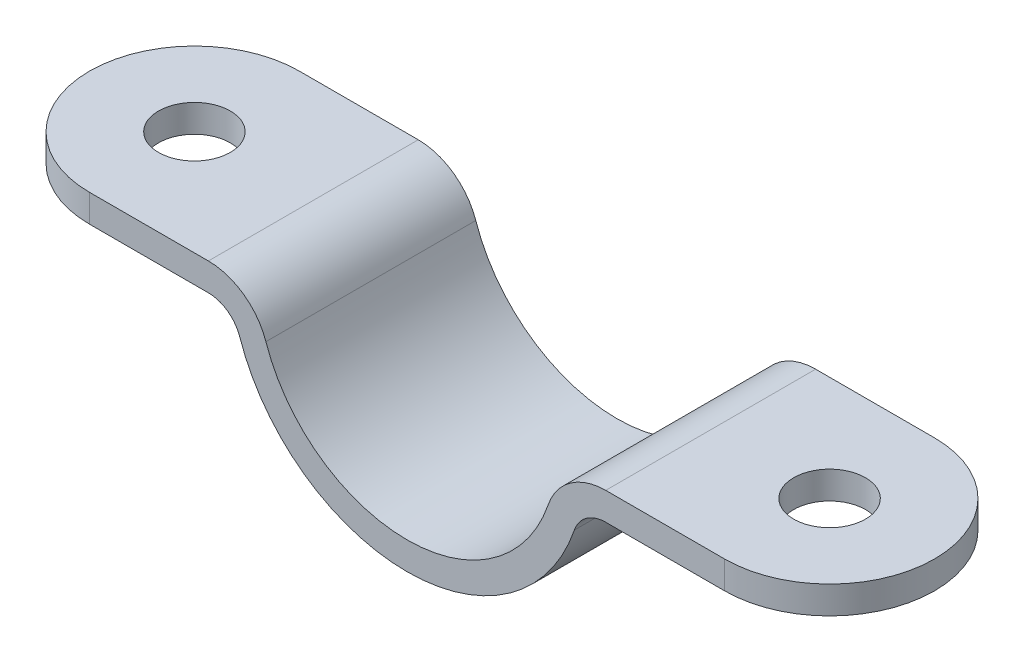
ISO-10303-21;
HEADER;
FILE_DESCRIPTION(('STEP AP214'),'2;1');
FILE_NAME('part.step','',(''),(''),'','','');
FILE_SCHEMA(('AUTOMOTIVE_DESIGN { 1 0 10303 214 1 1 1 1 }'));
ENDSEC;
DATA;
#1=APPLICATION_CONTEXT('core data for automotive mechanical design processes');
#2=APPLICATION_PROTOCOL_DEFINITION('international standard','automotive_design',2000,#1);
#3=PRODUCT_CONTEXT('',#1,'mechanical');
#4=PRODUCT('Part','Part','',(#3));
#5=PRODUCT_RELATED_PRODUCT_CATEGORY('part','',(#4));
#6=PRODUCT_DEFINITION_FORMATION('','',#4);
#7=PRODUCT_DEFINITION_CONTEXT('part definition',#1,'design');
#8=PRODUCT_DEFINITION('design','',#6,#7);
#9=PRODUCT_DEFINITION_SHAPE('','',#8);
#10=(LENGTH_UNIT() NAMED_UNIT(*) SI_UNIT(.MILLI.,.METRE.));
#11=(NAMED_UNIT(*) PLANE_ANGLE_UNIT() SI_UNIT($,.RADIAN.));
#12=(NAMED_UNIT(*) SI_UNIT($,.STERADIAN.) SOLID_ANGLE_UNIT());
#13=UNCERTAINTY_MEASURE_WITH_UNIT(LENGTH_MEASURE(1.E-05),#10,'distance_accuracy_value','');
#14=(GEOMETRIC_REPRESENTATION_CONTEXT(3) GLOBAL_UNCERTAINTY_ASSIGNED_CONTEXT((#13)) GLOBAL_UNIT_ASSIGNED_CONTEXT((#10,
#11,#12)) REPRESENTATION_CONTEXT('',''));
#15=CARTESIAN_POINT('',(0.,0.,0.));
#16=DIRECTION('',(0.,0.,1.));
#17=DIRECTION('',(1.,0.,0.));
#18=AXIS2_PLACEMENT_3D('',#15,#16,#17);
#19=CARTESIAN_POINT('',(31.3837139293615,-6.25,-38.));
#20=DIRECTION('',(0.,-1.,0.));
#21=DIRECTION('',(0.,0.,-1.));
#22=AXIS2_PLACEMENT_3D('',#19,#20,#21);
#23=PLANE('',#22);
#24=CARTESIAN_POINT('',(57.5,-6.25,-19.));
#25=DIRECTION('',(0.,-1.,0.));
#26=DIRECTION('',(0.,0.,-1.));
#27=AXIS2_PLACEMENT_3D('',#24,#25,#26);
#28=CIRCLE('',#27,6.5);
#29=CARTESIAN_POINT('',(57.5,-6.25,-25.5));
#30=VERTEX_POINT('',#29);
#31=EDGE_CURVE('E150',#30,#30,#28,.T.);
#32=ORIENTED_EDGE('',*,*,#31,.F.);
#33=EDGE_LOOP('',(#32));
#34=FACE_BOUND('',#33,.T.);
#35=DIRECTION('',(1.,0.,0.));
#36=VECTOR('',#35,1.);
#37=CARTESIAN_POINT('',(31.3837139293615,-6.25,0.));
#38=LINE('',#37,#36);
#39=CARTESIAN_POINT('',(35.9713427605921,-6.25,0.));
#40=VERTEX_POINT('',#39);
#41=CARTESIAN_POINT('',(57.5,-6.25,0.));
#42=VERTEX_POINT('',#41);
#43=EDGE_CURVE('E180',#40,#42,#38,.T.);
#44=ORIENTED_EDGE('',*,*,#43,.F.);
#45=DIRECTION('',(0.,0.,-1.));
#46=VECTOR('',#45,1.);
#47=CARTESIAN_POINT('',(35.9713427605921,-6.25,-38.));
#48=LINE('',#47,#46);
#49=CARTESIAN_POINT('',(35.9713427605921,-6.25,-38.));
#50=VERTEX_POINT('',#49);
#51=EDGE_CURVE('E212',#40,#50,#48,.T.);
#52=ORIENTED_EDGE('',*,*,#51,.T.);
#53=DIRECTION('',(1.,0.,0.));
#54=VECTOR('',#53,1.);
#55=CARTESIAN_POINT('',(31.3837139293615,-6.25,-38.));
#56=LINE('',#55,#54);
#57=CARTESIAN_POINT('',(57.5,-6.25,-38.));
#58=VERTEX_POINT('',#57);
#59=EDGE_CURVE('E183',#50,#58,#56,.T.);
#60=ORIENTED_EDGE('',*,*,#59,.T.);
#61=CARTESIAN_POINT('',(57.5,-6.25,-19.));
#62=DIRECTION('',(0.,-1.,0.));
#63=DIRECTION('',(0.,0.,-1.));
#64=AXIS2_PLACEMENT_3D('',#61,#62,#63);
#65=CIRCLE('',#64,19.);
#66=EDGE_CURVE('E196',#58,#42,#65,.T.);
#67=ORIENTED_EDGE('',*,*,#66,.T.);
#68=EDGE_LOOP('',(#44,#52,#60,#67));
#69=FACE_BOUND('',#68,.T.);
#70=ADVANCED_FACE('F34',(#34,#69),#23,.T.);
#71=CARTESIAN_POINT('',(35.9713427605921,-12.25,-38.));
#72=DIRECTION('',(0.,0.,1.));
#73=DIRECTION('',(1.,0.,0.));
#74=AXIS2_PLACEMENT_3D('',#71,#72,#73);
#75=CYLINDRICAL_SURFACE('',#74,6.);
#76=CARTESIAN_POINT('',(35.9713427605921,-12.25,-38.));
#77=DIRECTION('',(0.,0.,1.));
#78=DIRECTION('',(1.,0.,0.));
#79=AXIS2_PLACEMENT_3D('',#76,#77,#78);
#80=CIRCLE('',#79,6.);
#81=CARTESIAN_POINT('',(30.2916570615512,-10.3157894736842,-38.));
#82=VERTEX_POINT('',#81);
#83=EDGE_CURVE('E43',#50,#82,#80,.T.);
#84=ORIENTED_EDGE('',*,*,#83,.F.);
#85=ORIENTED_EDGE('',*,*,#51,.F.);
#86=CARTESIAN_POINT('',(35.9713427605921,-12.25,0.));
#87=DIRECTION('',(0.,0.,1.));
#88=DIRECTION('',(1.,0.,0.));
#89=AXIS2_PLACEMENT_3D('',#86,#87,#88);
#90=CIRCLE('',#89,6.);
#91=CARTESIAN_POINT('',(30.2916570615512,-10.3157894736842,0.));
#92=VERTEX_POINT('',#91);
#93=EDGE_CURVE('E58',#92,#40,#90,.F.);
#94=ORIENTED_EDGE('',*,*,#93,.F.);
#95=DIRECTION('',(0.,0.,1.));
#96=VECTOR('',#95,1.);
#97=CARTESIAN_POINT('',(30.2916570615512,-10.3157894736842,-38.));
#98=LINE('',#97,#96);
#99=EDGE_CURVE('E207',#82,#92,#98,.T.);
#100=ORIENTED_EDGE('',*,*,#99,.F.);
#101=EDGE_LOOP('',(#84,#85,#94,#100));
#102=FACE_BOUND('',#101,.T.);
#103=ADVANCED_FACE('F36',(#102),#75,.F.);
#104=CARTESIAN_POINT('',(0.,0.,-38.));
#105=DIRECTION('',(0.,0.,1.));
#106=DIRECTION('',(1.,0.,0.));
#107=AXIS2_PLACEMENT_3D('',#104,#105,#106);
#108=CYLINDRICAL_SURFACE('',#107,32.);
#109=CARTESIAN_POINT('',(0.,0.,0.));
#110=DIRECTION('',(0.,0.,1.));
#111=DIRECTION('',(1.,0.,0.));
#112=AXIS2_PLACEMENT_3D('',#109,#110,#111);
#113=CIRCLE('',#112,32.);
#114=CARTESIAN_POINT('',(-30.2916570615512,-10.3157894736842,0.));
#115=VERTEX_POINT('',#114);
#116=EDGE_CURVE('E189',#115,#92,#113,.T.);
#117=ORIENTED_EDGE('',*,*,#116,.F.);
#118=DIRECTION('',(0.,0.,1.));
#119=VECTOR('',#118,1.);
#120=CARTESIAN_POINT('',(-30.2916570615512,-10.3157894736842,-38.));
#121=LINE('',#120,#119);
#122=CARTESIAN_POINT('',(-30.2916570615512,-10.3157894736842,-38.));
#123=VERTEX_POINT('',#122);
#124=EDGE_CURVE('E210',#115,#123,#121,.F.);
#125=ORIENTED_EDGE('',*,*,#124,.T.);
#126=CARTESIAN_POINT('',(0.,0.,-38.));
#127=DIRECTION('',(0.,0.,1.));
#128=DIRECTION('',(1.,0.,0.));
#129=AXIS2_PLACEMENT_3D('',#126,#127,#128);
#130=CIRCLE('',#129,32.);
#131=EDGE_CURVE('E179',#123,#82,#130,.T.);
#132=ORIENTED_EDGE('',*,*,#131,.T.);
#133=ORIENTED_EDGE('',*,*,#99,.T.);
#134=EDGE_LOOP('',(#117,#125,#132,#133));
#135=FACE_BOUND('',#134,.T.);
#136=ADVANCED_FACE('F248',(#135),#108,.T.);
#137=CARTESIAN_POINT('',(-35.9713427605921,-12.25,-38.));
#138=DIRECTION('',(0.,0.,1.));
#139=DIRECTION('',(1.,0.,0.));
#140=AXIS2_PLACEMENT_3D('',#137,#138,#139);
#141=CYLINDRICAL_SURFACE('',#140,6.);
#142=CARTESIAN_POINT('',(-35.9713427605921,-12.25,-38.));
#143=DIRECTION('',(0.,0.,1.));
#144=DIRECTION('',(1.,0.,0.));
#145=AXIS2_PLACEMENT_3D('',#142,#143,#144);
#146=CIRCLE('',#145,6.);
#147=CARTESIAN_POINT('',(-35.9713427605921,-6.25,-38.));
#148=VERTEX_POINT('',#147);
#149=EDGE_CURVE('E216',#123,#148,#146,.T.);
#150=ORIENTED_EDGE('',*,*,#149,.F.);
#151=ORIENTED_EDGE('',*,*,#124,.F.);
#152=CARTESIAN_POINT('',(-35.9713427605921,-12.25,0.));
#153=DIRECTION('',(0.,0.,1.));
#154=DIRECTION('',(1.,0.,0.));
#155=AXIS2_PLACEMENT_3D('',#152,#153,#154);
#156=CIRCLE('',#155,6.);
#157=CARTESIAN_POINT('',(-35.9713427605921,-6.25,0.));
#158=VERTEX_POINT('',#157);
#159=EDGE_CURVE('E214',#158,#115,#156,.F.);
#160=ORIENTED_EDGE('',*,*,#159,.F.);
#161=DIRECTION('',(0.,0.,-1.));
#162=VECTOR('',#161,1.);
#163=CARTESIAN_POINT('',(-35.9713427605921,-6.25,0.));
#164=LINE('',#163,#162);
#165=EDGE_CURVE('E204',#148,#158,#164,.F.);
#166=ORIENTED_EDGE('',*,*,#165,.F.);
#167=EDGE_LOOP('',(#150,#151,#160,#166));
#168=FACE_BOUND('',#167,.T.);
#169=ADVANCED_FACE('F251',(#168),#141,.F.);
#170=CARTESIAN_POINT('',(-31.3837139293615,-6.25,-38.));
#171=DIRECTION('',(0.,-1.,0.));
#172=DIRECTION('',(0.,0.,-1.));
#173=AXIS2_PLACEMENT_3D('',#170,#171,#172);
#174=PLANE('',#173);
#175=CARTESIAN_POINT('',(-57.5,-6.25,-19.));
#176=DIRECTION('',(0.,-1.,0.));
#177=DIRECTION('',(0.,0.,-1.));
#178=AXIS2_PLACEMENT_3D('',#175,#176,#177);
#179=CIRCLE('',#178,6.5);
#180=CARTESIAN_POINT('',(-57.5,-6.25,-25.5));
#181=VERTEX_POINT('',#180);
#182=EDGE_CURVE('E221',#181,#181,#179,.T.);
#183=ORIENTED_EDGE('',*,*,#182,.F.);
#184=EDGE_LOOP('',(#183));
#185=FACE_BOUND('',#184,.T.);
#186=DIRECTION('',(1.,0.,0.));
#187=VECTOR('',#186,1.);
#188=CARTESIAN_POINT('',(-31.3837139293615,-6.25,-38.));
#189=LINE('',#188,#187);
#190=CARTESIAN_POINT('',(-57.5,-6.25,-38.));
#191=VERTEX_POINT('',#190);
#192=EDGE_CURVE('E176',#191,#148,#189,.T.);
#193=ORIENTED_EDGE('',*,*,#192,.T.);
#194=ORIENTED_EDGE('',*,*,#165,.T.);
#195=DIRECTION('',(1.,0.,0.));
#196=VECTOR('',#195,1.);
#197=CARTESIAN_POINT('',(-31.3837139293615,-6.25,0.));
#198=LINE('',#197,#196);
#199=CARTESIAN_POINT('',(-57.5,-6.25,0.));
#200=VERTEX_POINT('',#199);
#201=EDGE_CURVE('E175',#200,#158,#198,.T.);
#202=ORIENTED_EDGE('',*,*,#201,.F.);
#203=CARTESIAN_POINT('',(-57.5,-6.25,-19.));
#204=DIRECTION('',(0.,-1.,0.));
#205=DIRECTION('',(0.,0.,-1.));
#206=AXIS2_PLACEMENT_3D('',#203,#204,#205);
#207=CIRCLE('',#206,19.);
#208=EDGE_CURVE('E202',#200,#191,#207,.T.);
#209=ORIENTED_EDGE('',*,*,#208,.T.);
#210=EDGE_LOOP('',(#193,#194,#202,#209));
#211=FACE_BOUND('',#210,.T.);
#212=ADVANCED_FACE('F254',(#185,#211),#174,.T.);
#213=CARTESIAN_POINT('',(0.,0.,-38.));
#214=DIRECTION('',(0.,0.,1.));
#215=DIRECTION('',(1.,0.,0.));
#216=AXIS2_PLACEMENT_3D('',#213,#214,#215);
#217=PLANE('',#216);
#218=DIRECTION('',(0.,1.,0.));
#219=VECTOR('',#218,1.);
#220=CARTESIAN_POINT('',(-57.5,6.25,-38.));
#221=LINE('',#220,#219);
#222=CARTESIAN_POINT('',(-57.5,-1.25,-38.));
#223=VERTEX_POINT('',#222);
#224=EDGE_CURVE('E144',#191,#223,#221,.T.);
#225=ORIENTED_EDGE('',*,*,#224,.T.);
#226=DIRECTION('',(1.,0.,0.));
#227=VECTOR('',#226,1.);
#228=CARTESIAN_POINT('',(-76.5,-1.25,-38.));
#229=LINE('',#228,#227);
#230=CARTESIAN_POINT('',(-35.9713427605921,-1.25,-38.));
#231=VERTEX_POINT('',#230);
#232=EDGE_CURVE('E125',#223,#231,#229,.T.);
#233=ORIENTED_EDGE('',*,*,#232,.T.);
#234=CARTESIAN_POINT('',(-35.9713427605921,-12.25,-38.));
#235=DIRECTION('',(0.,0.,-1.));
#236=DIRECTION('',(1.,0.,0.));
#237=AXIS2_PLACEMENT_3D('',#234,#235,#236);
#238=CIRCLE('',#237,11.);
#239=CARTESIAN_POINT('',(-25.5585856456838,-8.70394736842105,-38.));
#240=VERTEX_POINT('',#239);
#241=EDGE_CURVE('E133',#231,#240,#238,.T.);
#242=ORIENTED_EDGE('',*,*,#241,.T.);
#243=CARTESIAN_POINT('',(0.,0.,-38.));
#244=DIRECTION('',(0.,0.,1.));
#245=DIRECTION('',(1.,0.,0.));
#246=AXIS2_PLACEMENT_3D('',#243,#244,#245);
#247=CIRCLE('',#246,27.);
#248=CARTESIAN_POINT('',(25.5585856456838,-8.70394736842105,-38.));
#249=VERTEX_POINT('',#248);
#250=EDGE_CURVE('E138',#240,#249,#247,.T.);
#251=ORIENTED_EDGE('',*,*,#250,.T.);
#252=CARTESIAN_POINT('',(35.9713427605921,-12.25,-38.));
#253=DIRECTION('',(0.,0.,-1.));
#254=DIRECTION('',(1.,0.,0.));
#255=AXIS2_PLACEMENT_3D('',#252,#253,#254);
#256=CIRCLE('',#255,11.);
#257=CARTESIAN_POINT('',(35.9713427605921,-1.25,-38.));
#258=VERTEX_POINT('',#257);
#259=EDGE_CURVE('E154',#249,#258,#256,.T.);
#260=ORIENTED_EDGE('',*,*,#259,.T.);
#261=DIRECTION('',(1.,0.,0.));
#262=VECTOR('',#261,1.);
#263=CARTESIAN_POINT('',(35.9713427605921,-1.25,-38.));
#264=LINE('',#263,#262);
#265=CARTESIAN_POINT('',(57.5,-1.25,-38.));
#266=VERTEX_POINT('',#265);
#267=EDGE_CURVE('E130',#258,#266,#264,.T.);
#268=ORIENTED_EDGE('',*,*,#267,.T.);
#269=DIRECTION('',(0.,-1.,0.));
#270=VECTOR('',#269,1.);
#271=CARTESIAN_POINT('',(57.5,-6.25,-38.));
#272=LINE('',#271,#270);
#273=EDGE_CURVE('E194',#266,#58,#272,.T.);
#274=ORIENTED_EDGE('',*,*,#273,.T.);
#275=ORIENTED_EDGE('',*,*,#59,.F.);
#276=ORIENTED_EDGE('',*,*,#83,.T.);
#277=ORIENTED_EDGE('',*,*,#131,.F.);
#278=ORIENTED_EDGE('',*,*,#149,.T.);
#279=ORIENTED_EDGE('',*,*,#192,.F.);
#280=EDGE_LOOP('',(#225,#233,#242,#251,#260,#268,#274,#275,#276,#277,#278,#279));
#281=FACE_BOUND('',#280,.T.);
#282=ADVANCED_FACE('F141',(#281),#217,.F.);
#283=CARTESIAN_POINT('',(0.,0.,0.));
#284=DIRECTION('',(0.,0.,1.));
#285=DIRECTION('',(1.,0.,0.));
#286=AXIS2_PLACEMENT_3D('',#283,#284,#285);
#287=PLANE('',#286);
#288=DIRECTION('',(1.,0.,0.));
#289=VECTOR('',#288,1.);
#290=CARTESIAN_POINT('',(0.,-1.25,0.));
#291=LINE('',#290,#289);
#292=CARTESIAN_POINT('',(-57.5,-1.25,0.));
#293=VERTEX_POINT('',#292);
#294=CARTESIAN_POINT('',(-35.9713427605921,-1.25,0.));
#295=VERTEX_POINT('',#294);
#296=EDGE_CURVE('E11',#293,#295,#291,.T.);
#297=ORIENTED_EDGE('',*,*,#296,.F.);
#298=DIRECTION('',(0.,-1.,0.));
#299=VECTOR('',#298,1.);
#300=CARTESIAN_POINT('',(-57.5,0.,0.));
#301=LINE('',#300,#299);
#302=EDGE_CURVE('E199',#293,#200,#301,.T.);
#303=ORIENTED_EDGE('',*,*,#302,.T.);
#304=ORIENTED_EDGE('',*,*,#201,.T.);
#305=ORIENTED_EDGE('',*,*,#159,.T.);
#306=ORIENTED_EDGE('',*,*,#116,.T.);
#307=ORIENTED_EDGE('',*,*,#93,.T.);
#308=ORIENTED_EDGE('',*,*,#43,.T.);
#309=DIRECTION('',(0.,1.,0.));
#310=VECTOR('',#309,1.);
#311=CARTESIAN_POINT('',(57.5,0.,0.));
#312=LINE('',#311,#310);
#313=CARTESIAN_POINT('',(57.5,-1.25,0.));
#314=VERTEX_POINT('',#313);
#315=EDGE_CURVE('E186',#42,#314,#312,.T.);
#316=ORIENTED_EDGE('',*,*,#315,.T.);
#317=DIRECTION('',(1.,0.,0.));
#318=VECTOR('',#317,1.);
#319=CARTESIAN_POINT('',(35.9713427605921,-1.25,0.));
#320=LINE('',#319,#318);
#321=CARTESIAN_POINT('',(35.9713427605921,-1.25,0.));
#322=VERTEX_POINT('',#321);
#323=EDGE_CURVE('E145',#322,#314,#320,.T.);
#324=ORIENTED_EDGE('',*,*,#323,.F.);
#325=CARTESIAN_POINT('',(35.9713427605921,-12.25,0.));
#326=DIRECTION('',(0.,0.,-1.));
#327=DIRECTION('',(1.,0.,0.));
#328=AXIS2_PLACEMENT_3D('',#325,#326,#327);
#329=CIRCLE('',#328,11.);
#330=CARTESIAN_POINT('',(25.5585856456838,-8.70394736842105,0.));
#331=VERTEX_POINT('',#330);
#332=EDGE_CURVE('E147',#331,#322,#329,.T.);
#333=ORIENTED_EDGE('',*,*,#332,.F.);
#334=CARTESIAN_POINT('',(0.,0.,0.));
#335=DIRECTION('',(0.,0.,1.));
#336=DIRECTION('',(1.,0.,0.));
#337=AXIS2_PLACEMENT_3D('',#334,#335,#336);
#338=CIRCLE('',#337,27.);
#339=CARTESIAN_POINT('',(-25.5585856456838,-8.70394736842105,0.));
#340=VERTEX_POINT('',#339);
#341=EDGE_CURVE('E161',#340,#331,#338,.T.);
#342=ORIENTED_EDGE('',*,*,#341,.F.);
#343=CARTESIAN_POINT('',(-35.9713427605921,-12.25,0.));
#344=DIRECTION('',(0.,0.,-1.));
#345=DIRECTION('',(1.,0.,0.));
#346=AXIS2_PLACEMENT_3D('',#343,#344,#345);
#347=CIRCLE('',#346,11.);
#348=EDGE_CURVE('E159',#295,#340,#347,.T.);
#349=ORIENTED_EDGE('',*,*,#348,.F.);
#350=EDGE_LOOP('',(#297,#303,#304,#305,#306,#307,#308,#316,#324,#333,#342,#349));
#351=FACE_BOUND('',#350,.T.);
#352=ADVANCED_FACE('F260',(#351),#287,.T.);
#353=CARTESIAN_POINT('',(57.5,-6.25,-19.));
#354=DIRECTION('',(0.,1.,0.));
#355=DIRECTION('',(-1.,0.,0.));
#356=AXIS2_PLACEMENT_3D('',#353,#354,#355);
#357=CYLINDRICAL_SURFACE('',#356,19.);
#358=CARTESIAN_POINT('',(57.5,-1.25,-19.));
#359=DIRECTION('',(0.,-1.,0.));
#360=DIRECTION('',(0.,0.,-1.));
#361=AXIS2_PLACEMENT_3D('',#358,#359,#360);
#362=CIRCLE('',#361,19.);
#363=EDGE_CURVE('E168',#314,#266,#362,.F.);
#364=ORIENTED_EDGE('',*,*,#363,.F.);
#365=ORIENTED_EDGE('',*,*,#315,.F.);
#366=ORIENTED_EDGE('',*,*,#66,.F.);
#367=ORIENTED_EDGE('',*,*,#273,.F.);
#368=EDGE_LOOP('',(#364,#365,#366,#367));
#369=FACE_BOUND('',#368,.T.);
#370=ADVANCED_FACE('F275',(#369),#357,.T.);
#371=CARTESIAN_POINT('',(-57.5,6.25,-19.));
#372=DIRECTION('',(0.,-1.,0.));
#373=DIRECTION('',(1.,0.,0.));
#374=AXIS2_PLACEMENT_3D('',#371,#372,#373);
#375=CYLINDRICAL_SURFACE('',#374,19.);
#376=CARTESIAN_POINT('',(-57.5,-1.25,-19.));
#377=DIRECTION('',(0.,-1.,0.));
#378=DIRECTION('',(0.,0.,-1.));
#379=AXIS2_PLACEMENT_3D('',#376,#377,#378);
#380=CIRCLE('',#379,19.);
#381=EDGE_CURVE('E173',#223,#293,#380,.F.);
#382=ORIENTED_EDGE('',*,*,#381,.F.);
#383=ORIENTED_EDGE('',*,*,#224,.F.);
#384=ORIENTED_EDGE('',*,*,#208,.F.);
#385=ORIENTED_EDGE('',*,*,#302,.F.);
#386=EDGE_LOOP('',(#382,#383,#384,#385));
#387=FACE_BOUND('',#386,.T.);
#388=ADVANCED_FACE('F259',(#387),#375,.T.);
#389=CARTESIAN_POINT('',(-35.9713427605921,-12.25,-38.));
#390=DIRECTION('',(0.,0.,1.));
#391=DIRECTION('',(1.,0.,0.));
#392=AXIS2_PLACEMENT_3D('',#389,#390,#391);
#393=CYLINDRICAL_SURFACE('',#392,11.);
#394=ORIENTED_EDGE('',*,*,#348,.T.);
#395=DIRECTION('',(0.,0.,1.));
#396=VECTOR('',#395,1.);
#397=CARTESIAN_POINT('',(-25.5585856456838,-8.70394736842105,-38.));
#398=LINE('',#397,#396);
#399=EDGE_CURVE('E129',#240,#340,#398,.T.);
#400=ORIENTED_EDGE('',*,*,#399,.F.);
#401=ORIENTED_EDGE('',*,*,#241,.F.);
#402=DIRECTION('',(0.,0.,1.));
#403=VECTOR('',#402,1.);
#404=CARTESIAN_POINT('',(-35.9713427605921,-1.25,-38.));
#405=LINE('',#404,#403);
#406=EDGE_CURVE('E51',#231,#295,#405,.T.);
#407=ORIENTED_EDGE('',*,*,#406,.T.);
#408=EDGE_LOOP('',(#394,#400,#401,#407));
#409=FACE_BOUND('',#408,.T.);
#410=ADVANCED_FACE('F134',(#409),#393,.T.);
#411=CARTESIAN_POINT('',(0.,0.,-38.));
#412=DIRECTION('',(0.,0.,1.));
#413=DIRECTION('',(1.,0.,0.));
#414=AXIS2_PLACEMENT_3D('',#411,#412,#413);
#415=CYLINDRICAL_SURFACE('',#414,27.);
#416=ORIENTED_EDGE('',*,*,#341,.T.);
#417=DIRECTION('',(0.,0.,1.));
#418=VECTOR('',#417,1.);
#419=CARTESIAN_POINT('',(25.5585856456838,-8.70394736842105,-38.));
#420=LINE('',#419,#418);
#421=EDGE_CURVE('E169',#249,#331,#420,.T.);
#422=ORIENTED_EDGE('',*,*,#421,.F.);
#423=ORIENTED_EDGE('',*,*,#250,.F.);
#424=ORIENTED_EDGE('',*,*,#399,.T.);
#425=EDGE_LOOP('',(#416,#422,#423,#424));
#426=FACE_BOUND('',#425,.T.);
#427=ADVANCED_FACE('F265',(#426),#415,.F.);
#428=CARTESIAN_POINT('',(35.9713427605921,-12.25,-38.));
#429=DIRECTION('',(0.,0.,1.));
#430=DIRECTION('',(1.,0.,0.));
#431=AXIS2_PLACEMENT_3D('',#428,#429,#430);
#432=CYLINDRICAL_SURFACE('',#431,11.);
#433=ORIENTED_EDGE('',*,*,#332,.T.);
#434=DIRECTION('',(0.,0.,1.));
#435=VECTOR('',#434,1.);
#436=CARTESIAN_POINT('',(35.9713427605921,-1.25,-38.));
#437=LINE('',#436,#435);
#438=EDGE_CURVE('E166',#258,#322,#437,.T.);
#439=ORIENTED_EDGE('',*,*,#438,.F.);
#440=ORIENTED_EDGE('',*,*,#259,.F.);
#441=ORIENTED_EDGE('',*,*,#421,.T.);
#442=EDGE_LOOP('',(#433,#439,#440,#441));
#443=FACE_BOUND('',#442,.T.);
#444=ADVANCED_FACE('F270',(#443),#432,.T.);
#445=CARTESIAN_POINT('',(35.9713427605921,-1.25,-38.));
#446=DIRECTION('',(0.,-1.,0.));
#447=DIRECTION('',(0.,0.,-1.));
#448=AXIS2_PLACEMENT_3D('',#445,#446,#447);
#449=PLANE('',#448);
#450=CARTESIAN_POINT('',(57.5,-1.24999999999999,-19.));
#451=DIRECTION('',(0.,-1.,0.));
#452=DIRECTION('',(0.,0.,-1.));
#453=AXIS2_PLACEMENT_3D('',#450,#451,#452);
#454=CIRCLE('',#453,6.5);
#455=CARTESIAN_POINT('',(57.5,-1.24999999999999,-25.5));
#456=VERTEX_POINT('',#455);
#457=EDGE_CURVE('E38',#456,#456,#454,.T.);
#458=ORIENTED_EDGE('',*,*,#457,.T.);
#459=EDGE_LOOP('',(#458));
#460=FACE_BOUND('',#459,.T.);
#461=ORIENTED_EDGE('',*,*,#363,.T.);
#462=ORIENTED_EDGE('',*,*,#267,.F.);
#463=ORIENTED_EDGE('',*,*,#438,.T.);
#464=ORIENTED_EDGE('',*,*,#323,.T.);
#465=EDGE_LOOP('',(#461,#462,#463,#464));
#466=FACE_BOUND('',#465,.T.);
#467=ADVANCED_FACE('F272',(#460,#466),#449,.F.);
#468=CARTESIAN_POINT('',(-76.5,-1.25,-38.));
#469=DIRECTION('',(0.,-1.,0.));
#470=DIRECTION('',(0.,0.,-1.));
#471=AXIS2_PLACEMENT_3D('',#468,#469,#470);
#472=PLANE('',#471);
#473=CARTESIAN_POINT('',(-57.5,-1.25,-19.));
#474=DIRECTION('',(0.,-1.,0.));
#475=DIRECTION('',(0.,0.,-1.));
#476=AXIS2_PLACEMENT_3D('',#473,#474,#475);
#477=CIRCLE('',#476,6.5);
#478=CARTESIAN_POINT('',(-57.5,-1.25,-25.5));
#479=VERTEX_POINT('',#478);
#480=EDGE_CURVE('E219',#479,#479,#477,.T.);
#481=ORIENTED_EDGE('',*,*,#480,.T.);
#482=EDGE_LOOP('',(#481));
#483=FACE_BOUND('',#482,.T.);
#484=ORIENTED_EDGE('',*,*,#381,.T.);
#485=ORIENTED_EDGE('',*,*,#296,.T.);
#486=ORIENTED_EDGE('',*,*,#406,.F.);
#487=ORIENTED_EDGE('',*,*,#232,.F.);
#488=EDGE_LOOP('',(#484,#485,#486,#487));
#489=FACE_BOUND('',#488,.T.);
#490=ADVANCED_FACE('F123',(#483,#489),#472,.F.);
#491=CARTESIAN_POINT('',(-57.5,57.5,-19.));
#492=DIRECTION('',(0.,-1.,0.));
#493=DIRECTION('',(0.,0.,-1.));
#494=AXIS2_PLACEMENT_3D('',#491,#492,#493);
#495=CYLINDRICAL_SURFACE('',#494,6.5);
#496=ORIENTED_EDGE('',*,*,#182,.T.);
#497=EDGE_LOOP('',(#496));
#498=FACE_BOUND('',#497,.T.);
#499=ORIENTED_EDGE('',*,*,#480,.F.);
#500=EDGE_LOOP('',(#499));
#501=FACE_BOUND('',#500,.T.);
#502=ADVANCED_FACE('F306',(#498,#501),#495,.F.);
#503=CARTESIAN_POINT('',(57.5,57.5,-19.));
#504=DIRECTION('',(0.,-1.,0.));
#505=DIRECTION('',(0.,0.,-1.));
#506=AXIS2_PLACEMENT_3D('',#503,#504,#505);
#507=CYLINDRICAL_SURFACE('',#506,6.5);
#508=ORIENTED_EDGE('',*,*,#31,.T.);
#509=EDGE_LOOP('',(#508));
#510=FACE_BOUND('',#509,.T.);
#511=ORIENTED_EDGE('',*,*,#457,.F.);
#512=EDGE_LOOP('',(#511));
#513=FACE_BOUND('',#512,.T.);
#514=ADVANCED_FACE('F231',(#510,#513),#507,.F.);
#515=CLOSED_SHELL('',(#70,#103,#136,#169,#212,#282,#352,#370,#388,#410,#427,#444,#467,#490,#502,#514));
#516=MANIFOLD_SOLID_BREP('B2',#515);
#517=ADVANCED_BREP_SHAPE_REPRESENTATION('',(#18,#516),#14);
#518=SHAPE_DEFINITION_REPRESENTATION(#9,#517);
ENDSEC;
END-ISO-10303-21;
